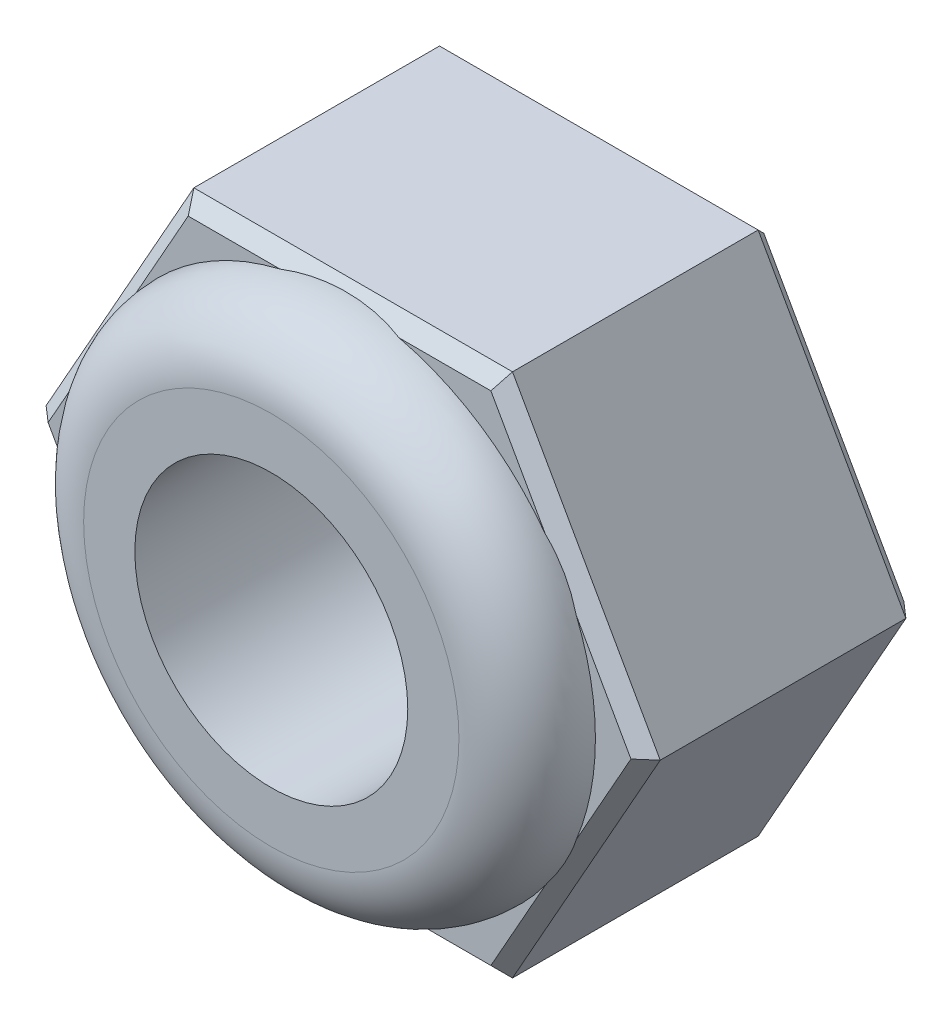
ISO-10303-21;
HEADER;
FILE_DESCRIPTION(('STEP AP214'),'2;1');
FILE_NAME('part.step','',(''),(''),'','','');
FILE_SCHEMA(('AUTOMOTIVE_DESIGN { 1 0 10303 214 1 1 1 1 }'));
ENDSEC;
DATA;
#1=APPLICATION_CONTEXT('core data for automotive mechanical design processes');
#2=APPLICATION_PROTOCOL_DEFINITION('international standard','automotive_design',2000,#1);
#3=PRODUCT_CONTEXT('',#1,'mechanical');
#4=PRODUCT('Part','Part','',(#3));
#5=PRODUCT_RELATED_PRODUCT_CATEGORY('part','',(#4));
#6=PRODUCT_DEFINITION_FORMATION('','',#4);
#7=PRODUCT_DEFINITION_CONTEXT('part definition',#1,'design');
#8=PRODUCT_DEFINITION('design','',#6,#7);
#9=PRODUCT_DEFINITION_SHAPE('','',#8);
#10=(LENGTH_UNIT() NAMED_UNIT(*) SI_UNIT(.MILLI.,.METRE.));
#11=(NAMED_UNIT(*) PLANE_ANGLE_UNIT() SI_UNIT($,.RADIAN.));
#12=(NAMED_UNIT(*) SI_UNIT($,.STERADIAN.) SOLID_ANGLE_UNIT());
#13=UNCERTAINTY_MEASURE_WITH_UNIT(LENGTH_MEASURE(1.E-05),#10,'distance_accuracy_value','');
#14=(GEOMETRIC_REPRESENTATION_CONTEXT(3) GLOBAL_UNCERTAINTY_ASSIGNED_CONTEXT((#13)) GLOBAL_UNIT_ASSIGNED_CONTEXT((#10,
#11,#12)) REPRESENTATION_CONTEXT('',''));
#15=CARTESIAN_POINT('',(0.,0.,0.));
#16=DIRECTION('',(0.,0.,1.));
#17=DIRECTION('',(1.,0.,0.));
#18=AXIS2_PLACEMENT_3D('',#15,#16,#17);
#19=CARTESIAN_POINT('',(2.3348277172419,3.84689219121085,4.));
#20=DIRECTION('',(0.,0.,1.));
#21=DIRECTION('',(1.,0.,0.));
#22=AXIS2_PLACEMENT_3D('',#19,#20,#21);
#23=PLANE('',#22);
#24=DIRECTION('',(-1.,0.,0.));
#25=VECTOR('',#24,1.);
#26=CARTESIAN_POINT('',(2.3348277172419,3.64689219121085,4.));
#27=LINE('',#26,#25);
#28=CARTESIAN_POINT('',(-0.873314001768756,3.64689219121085,4.));
#29=VERTEX_POINT('',#28);
#30=CARTESIAN_POINT('',(-2.21789254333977,3.64689219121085,4.));
#31=VERTEX_POINT('',#30);
#32=EDGE_CURVE('E189',#29,#31,#27,.T.);
#33=ORIENTED_EDGE('',*,*,#32,.T.);
#34=DIRECTION('',(-0.490484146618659,-0.871450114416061,0.));
#35=VECTOR('',#34,1.);
#36=CARTESIAN_POINT('',(-1.03713674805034,5.74475769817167,4.));
#37=LINE('',#36,#35);
#38=CARTESIAN_POINT('',(-3.01689000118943,2.2273021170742,4.));
#39=VERTEX_POINT('',#38);
#40=EDGE_CURVE('E157',#31,#39,#37,.T.);
#41=ORIENTED_EDGE('',*,*,#40,.T.);
#42=CARTESIAN_POINT('',(0.,0.,4.));
#43=DIRECTION('',(0.,0.,1.));
#44=DIRECTION('',(1.,0.,0.));
#45=AXIS2_PLACEMENT_3D('',#42,#43,#44);
#46=CIRCLE('',#45,3.75);
#47=EDGE_CURVE('E295',#29,#39,#46,.T.);
#48=ORIENTED_EDGE('',*,*,#47,.F.);
#49=EDGE_LOOP('',(#33,#41,#48));
#50=FACE_BOUND('',#49,.T.);
#51=ADVANCED_FACE('F26',(#50),#23,.T.);
#52=CARTESIAN_POINT('',(-3.46935767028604,1.42339641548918,4.));
#53=VERTEX_POINT('',#52);
#54=CARTESIAN_POINT('',(-3.46935767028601,-1.42339641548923,4.));
#55=VERTEX_POINT('',#54);
#56=EDGE_CURVE('E363',#53,#55,#46,.T.);
#57=ORIENTED_EDGE('',*,*,#56,.F.);
#58=DIRECTION('',(-0.490484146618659,-0.871450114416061,0.));
#59=VECTOR('',#58,1.);
#60=CARTESIAN_POINT('',(-1.03713674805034,5.74475769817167,4.));
#61=LINE('',#60,#59);
#62=CARTESIAN_POINT('',(-4.27049747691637,0.,4.));
#63=VERTEX_POINT('',#62);
#64=EDGE_CURVE('E314',#53,#63,#61,.T.);
#65=ORIENTED_EDGE('',*,*,#64,.T.);
#66=DIRECTION('',(0.490484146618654,-0.871450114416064,0.));
#67=VECTOR('',#66,1.);
#68=CARTESIAN_POINT('',(-2.16053769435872,-3.74879536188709,4.));
#69=LINE('',#68,#67);
#70=EDGE_CURVE('E312',#63,#55,#69,.T.);
#71=ORIENTED_EDGE('',*,*,#70,.T.);
#72=EDGE_LOOP('',(#57,#65,#71));
#73=FACE_BOUND('',#72,.T.);
#74=ADVANCED_FACE('F266',(#73),#23,.T.);
#75=CARTESIAN_POINT('',(-3.01689000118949,-2.22730211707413,4.));
#76=VERTEX_POINT('',#75);
#77=CARTESIAN_POINT('',(-0.873314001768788,-3.64689219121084,4.));
#78=VERTEX_POINT('',#77);
#79=EDGE_CURVE('E335',#76,#78,#46,.T.);
#80=ORIENTED_EDGE('',*,*,#79,.F.);
#81=DIRECTION('',(0.490484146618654,-0.871450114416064,0.));
#82=VECTOR('',#81,1.);
#83=CARTESIAN_POINT('',(-2.16053769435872,-3.74879536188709,4.));
#84=LINE('',#83,#82);
#85=CARTESIAN_POINT('',(-2.21789254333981,-3.64689219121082,4.));
#86=VERTEX_POINT('',#85);
#87=EDGE_CURVE('E310',#76,#86,#84,.T.);
#88=ORIENTED_EDGE('',*,*,#87,.T.);
#89=DIRECTION('',(1.,0.,0.));
#90=VECTOR('',#89,1.);
#91=CARTESIAN_POINT('',(2.33482771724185,-3.64689219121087,4.));
#92=LINE('',#91,#90);
#93=EDGE_CURVE('E308',#86,#78,#92,.T.);
#94=ORIENTED_EDGE('',*,*,#93,.T.);
#95=EDGE_LOOP('',(#80,#88,#94));
#96=FACE_BOUND('',#95,.T.);
#97=ADVANCED_FACE('F273',(#96),#23,.T.);
#98=CARTESIAN_POINT('',(0.873314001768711,-3.64689219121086,4.));
#99=VERTEX_POINT('',#98);
#100=CARTESIAN_POINT('',(3.01689000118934,-2.22730211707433,4.));
#101=VERTEX_POINT('',#100);
#102=EDGE_CURVE('E333',#99,#101,#46,.T.);
#103=ORIENTED_EDGE('',*,*,#102,.F.);
#104=DIRECTION('',(1.,0.,0.));
#105=VECTOR('',#104,1.);
#106=CARTESIAN_POINT('',(2.33482771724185,-3.64689219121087,4.));
#107=LINE('',#106,#105);
#108=CARTESIAN_POINT('',(2.21789254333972,-3.64689219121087,4.));
#109=VERTEX_POINT('',#108);
#110=EDGE_CURVE('E306',#99,#109,#107,.T.);
#111=ORIENTED_EDGE('',*,*,#110,.T.);
#112=DIRECTION('',(0.490484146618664,0.871450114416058,0.));
#113=VECTOR('',#112,1.);
#114=CARTESIAN_POINT('',(4.32570997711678,0.098096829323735,4.));
#115=LINE('',#114,#113);
#116=EDGE_CURVE('E304',#109,#101,#115,.T.);
#117=ORIENTED_EDGE('',*,*,#116,.T.);
#118=EDGE_LOOP('',(#103,#111,#117));
#119=FACE_BOUND('',#118,.T.);
#120=ADVANCED_FACE('F286',(#119),#23,.T.);
#121=CARTESIAN_POINT('',(3.46935767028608,-1.42339641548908,4.));
#122=VERTEX_POINT('',#121);
#123=CARTESIAN_POINT('',(3.46935767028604,1.42339641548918,4.));
#124=VERTEX_POINT('',#123);
#125=EDGE_CURVE('E292',#122,#124,#46,.T.);
#126=ORIENTED_EDGE('',*,*,#125,.F.);
#127=DIRECTION('',(0.490484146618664,0.871450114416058,0.));
#128=VECTOR('',#127,1.);
#129=CARTESIAN_POINT('',(4.32570997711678,0.098096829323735,4.));
#130=LINE('',#129,#128);
#131=CARTESIAN_POINT('',(4.27049747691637,0.,4.));
#132=VERTEX_POINT('',#131);
#133=EDGE_CURVE('E300',#122,#132,#130,.T.);
#134=ORIENTED_EDGE('',*,*,#133,.T.);
#135=DIRECTION('',(-0.490484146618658,0.871450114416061,0.));
#136=VECTOR('',#135,1.);
#137=CARTESIAN_POINT('',(2.16053769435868,3.74879536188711,4.));
#138=LINE('',#137,#136);
#139=EDGE_CURVE('E298',#132,#124,#138,.T.);
#140=ORIENTED_EDGE('',*,*,#139,.T.);
#141=EDGE_LOOP('',(#126,#134,#140));
#142=FACE_BOUND('',#141,.T.);
#143=ADVANCED_FACE('F279',(#142),#23,.T.);
#144=CARTESIAN_POINT('',(3.01689000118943,2.2273021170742,4.));
#145=VERTEX_POINT('',#144);
#146=CARTESIAN_POINT('',(0.873314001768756,3.64689219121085,4.));
#147=VERTEX_POINT('',#146);
#148=EDGE_CURVE('E289',#145,#147,#46,.T.);
#149=ORIENTED_EDGE('',*,*,#148,.F.);
#150=DIRECTION('',(-0.490484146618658,0.871450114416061,0.));
#151=VECTOR('',#150,1.);
#152=CARTESIAN_POINT('',(2.16053769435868,3.74879536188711,4.));
#153=LINE('',#152,#151);
#154=CARTESIAN_POINT('',(2.21789254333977,3.64689219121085,4.));
#155=VERTEX_POINT('',#154);
#156=EDGE_CURVE('E162',#145,#155,#153,.T.);
#157=ORIENTED_EDGE('',*,*,#156,.T.);
#158=DIRECTION('',(-1.,0.,0.));
#159=VECTOR('',#158,1.);
#160=CARTESIAN_POINT('',(2.3348277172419,3.64689219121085,4.));
#161=LINE('',#160,#159);
#162=EDGE_CURVE('E192',#155,#147,#161,.T.);
#163=ORIENTED_EDGE('',*,*,#162,.T.);
#164=EDGE_LOOP('',(#149,#157,#163));
#165=FACE_BOUND('',#164,.T.);
#166=ADVANCED_FACE('F269',(#165),#23,.T.);
#167=CARTESIAN_POINT('',(2.3348277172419,3.84689219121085,4.));
#168=DIRECTION('',(0.871450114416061,0.490484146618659,0.));
#169=DIRECTION('',(-0.490484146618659,0.871450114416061,0.));
#170=AXIS2_PLACEMENT_3D('',#167,#168,#169);
#171=PLANE('',#170);
#172=DIRECTION('',(0.,0.,-1.));
#173=VECTOR('',#172,1.);
#174=CARTESIAN_POINT('',(4.5,0.,4.));
#175=LINE('',#174,#173);
#176=CARTESIAN_POINT('',(4.5,0.,3.8));
#177=VERTEX_POINT('',#176);
#178=CARTESIAN_POINT('',(4.5,0.,0.200000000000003));
#179=VERTEX_POINT('',#178);
#180=EDGE_CURVE('E362',#177,#179,#175,.T.);
#181=ORIENTED_EDGE('',*,*,#180,.T.);
#182=DIRECTION('',(-0.490484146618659,0.871450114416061,0.));
#183=VECTOR('',#182,1.);
#184=CARTESIAN_POINT('',(2.3348277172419,3.84689219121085,0.200000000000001));
#185=LINE('',#184,#183);
#186=CARTESIAN_POINT('',(2.3348277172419,3.84689219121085,0.200000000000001));
#187=VERTEX_POINT('',#186);
#188=EDGE_CURVE('E377',#179,#187,#185,.T.);
#189=ORIENTED_EDGE('',*,*,#188,.T.);
#190=DIRECTION('',(0.,0.,-1.));
#191=VECTOR('',#190,1.);
#192=CARTESIAN_POINT('',(2.3348277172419,3.84689219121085,4.));
#193=LINE('',#192,#191);
#194=CARTESIAN_POINT('',(2.3348277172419,3.84689219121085,3.8));
#195=VERTEX_POINT('',#194);
#196=EDGE_CURVE('E184',#195,#187,#193,.T.);
#197=ORIENTED_EDGE('',*,*,#196,.F.);
#198=DIRECTION('',(0.490484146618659,-0.871450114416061,0.));
#199=VECTOR('',#198,1.);
#200=CARTESIAN_POINT('',(2.3348277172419,3.84689219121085,3.8));
#201=LINE('',#200,#199);
#202=EDGE_CURVE('E322',#195,#177,#201,.T.);
#203=ORIENTED_EDGE('',*,*,#202,.T.);
#204=EDGE_LOOP('',(#181,#189,#197,#203));
#205=FACE_BOUND('',#204,.T.);
#206=ADVANCED_FACE('F278',(#205),#171,.T.);
#207=CARTESIAN_POINT('',(-2.3348277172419,3.84689219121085,4.));
#208=DIRECTION('',(0.,1.,0.));
#209=DIRECTION('',(0.,0.,1.));
#210=AXIS2_PLACEMENT_3D('',#207,#208,#209);
#211=PLANE('',#210);
#212=ORIENTED_EDGE('',*,*,#196,.T.);
#213=DIRECTION('',(-1.,0.,0.));
#214=VECTOR('',#213,1.);
#215=CARTESIAN_POINT('',(-2.3348277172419,3.84689219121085,0.200000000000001));
#216=LINE('',#215,#214);
#217=CARTESIAN_POINT('',(-2.3348277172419,3.84689219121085,0.200000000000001));
#218=VERTEX_POINT('',#217);
#219=EDGE_CURVE('E183',#187,#218,#216,.T.);
#220=ORIENTED_EDGE('',*,*,#219,.T.);
#221=DIRECTION('',(0.,0.,-1.));
#222=VECTOR('',#221,1.);
#223=CARTESIAN_POINT('',(-2.3348277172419,3.84689219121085,4.));
#224=LINE('',#223,#222);
#225=CARTESIAN_POINT('',(-2.3348277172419,3.84689219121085,3.8));
#226=VERTEX_POINT('',#225);
#227=EDGE_CURVE('E170',#226,#218,#224,.T.);
#228=ORIENTED_EDGE('',*,*,#227,.F.);
#229=DIRECTION('',(1.,0.,0.));
#230=VECTOR('',#229,1.);
#231=CARTESIAN_POINT('',(-2.3348277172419,3.84689219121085,3.8));
#232=LINE('',#231,#230);
#233=EDGE_CURVE('E180',#226,#195,#232,.T.);
#234=ORIENTED_EDGE('',*,*,#233,.T.);
#235=EDGE_LOOP('',(#212,#220,#228,#234));
#236=FACE_BOUND('',#235,.T.);
#237=ADVANCED_FACE('F28',(#236),#211,.T.);
#238=CARTESIAN_POINT('',(-4.5,0.,4.));
#239=DIRECTION('',(-0.871450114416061,0.490484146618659,0.));
#240=DIRECTION('',(-0.490484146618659,-0.871450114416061,0.));
#241=AXIS2_PLACEMENT_3D('',#238,#239,#240);
#242=PLANE('',#241);
#243=ORIENTED_EDGE('',*,*,#227,.T.);
#244=DIRECTION('',(-0.490484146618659,-0.871450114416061,0.));
#245=VECTOR('',#244,1.);
#246=CARTESIAN_POINT('',(-4.5,0.,0.2));
#247=LINE('',#246,#245);
#248=CARTESIAN_POINT('',(-4.5,0.,0.200000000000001));
#249=VERTEX_POINT('',#248);
#250=EDGE_CURVE('E388',#218,#249,#247,.T.);
#251=ORIENTED_EDGE('',*,*,#250,.T.);
#252=DIRECTION('',(0.,0.,-1.));
#253=VECTOR('',#252,1.);
#254=CARTESIAN_POINT('',(-4.5,0.,4.));
#255=LINE('',#254,#253);
#256=CARTESIAN_POINT('',(-4.5,0.,3.8));
#257=VERTEX_POINT('',#256);
#258=EDGE_CURVE('E173',#257,#249,#255,.T.);
#259=ORIENTED_EDGE('',*,*,#258,.F.);
#260=DIRECTION('',(0.490484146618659,0.871450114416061,0.));
#261=VECTOR('',#260,1.);
#262=CARTESIAN_POINT('',(-4.5,0.,3.8));
#263=LINE('',#262,#261);
#264=EDGE_CURVE('E156',#257,#226,#263,.T.);
#265=ORIENTED_EDGE('',*,*,#264,.T.);
#266=EDGE_LOOP('',(#243,#251,#259,#265));
#267=FACE_BOUND('',#266,.T.);
#268=ADVANCED_FACE('F169',(#267),#242,.T.);
#269=CARTESIAN_POINT('',(-4.5,0.,4.));
#270=DIRECTION('',(0.871450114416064,0.490484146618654,0.));
#271=DIRECTION('',(-0.490484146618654,0.871450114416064,0.));
#272=AXIS2_PLACEMENT_3D('',#269,#270,#271);
#273=PLANE('',#272);
#274=ORIENTED_EDGE('',*,*,#258,.T.);
#275=DIRECTION('',(0.490484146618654,-0.871450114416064,0.));
#276=VECTOR('',#275,1.);
#277=CARTESIAN_POINT('',(-4.5,0.,0.200000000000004));
#278=LINE('',#277,#276);
#279=CARTESIAN_POINT('',(-2.33482771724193,-3.84689219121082,0.200000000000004));
#280=VERTEX_POINT('',#279);
#281=EDGE_CURVE('E404',#249,#280,#278,.T.);
#282=ORIENTED_EDGE('',*,*,#281,.T.);
#283=DIRECTION('',(0.,0.,-1.));
#284=VECTOR('',#283,1.);
#285=CARTESIAN_POINT('',(-2.33482771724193,-3.84689219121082,4.));
#286=LINE('',#285,#284);
#287=CARTESIAN_POINT('',(-2.33482771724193,-3.84689219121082,3.8));
#288=VERTEX_POINT('',#287);
#289=EDGE_CURVE('E367',#288,#280,#286,.T.);
#290=ORIENTED_EDGE('',*,*,#289,.F.);
#291=DIRECTION('',(-0.490484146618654,0.871450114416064,0.));
#292=VECTOR('',#291,1.);
#293=CARTESIAN_POINT('',(-4.5,0.,3.8));
#294=LINE('',#293,#292);
#295=EDGE_CURVE('E317',#288,#257,#294,.T.);
#296=ORIENTED_EDGE('',*,*,#295,.T.);
#297=EDGE_LOOP('',(#274,#282,#290,#296));
#298=FACE_BOUND('',#297,.T.);
#299=ADVANCED_FACE('F415',(#298),#273,.F.);
#300=CARTESIAN_POINT('',(-2.33482771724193,-3.84689219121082,4.));
#301=DIRECTION('',(0.,1.,0.));
#302=DIRECTION('',(-1.,0.,0.));
#303=AXIS2_PLACEMENT_3D('',#300,#301,#302);
#304=PLANE('',#303);
#305=ORIENTED_EDGE('',*,*,#289,.T.);
#306=DIRECTION('',(1.,0.,0.));
#307=VECTOR('',#306,1.);
#308=CARTESIAN_POINT('',(-2.33482771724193,-3.84689219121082,0.200000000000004));
#309=LINE('',#308,#307);
#310=CARTESIAN_POINT('',(2.33482771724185,-3.84689219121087,0.200000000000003));
#311=VERTEX_POINT('',#310);
#312=EDGE_CURVE('E11',#280,#311,#309,.T.);
#313=ORIENTED_EDGE('',*,*,#312,.T.);
#314=DIRECTION('',(0.,0.,-1.));
#315=VECTOR('',#314,1.);
#316=CARTESIAN_POINT('',(2.33482771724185,-3.84689219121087,4.));
#317=LINE('',#316,#315);
#318=CARTESIAN_POINT('',(2.33482771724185,-3.84689219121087,3.8));
#319=VERTEX_POINT('',#318);
#320=EDGE_CURVE('E365',#319,#311,#317,.T.);
#321=ORIENTED_EDGE('',*,*,#320,.F.);
#322=DIRECTION('',(-1.,0.,0.));
#323=VECTOR('',#322,1.);
#324=CARTESIAN_POINT('',(-2.33482771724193,-3.84689219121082,3.8));
#325=LINE('',#324,#323);
#326=EDGE_CURVE('E319',#319,#288,#325,.T.);
#327=ORIENTED_EDGE('',*,*,#326,.T.);
#328=EDGE_LOOP('',(#305,#313,#321,#327));
#329=FACE_BOUND('',#328,.T.);
#330=ADVANCED_FACE('F414',(#329),#304,.F.);
#331=CARTESIAN_POINT('',(2.33482771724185,-3.84689219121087,4.));
#332=DIRECTION('',(-0.871450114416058,0.490484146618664,0.));
#333=DIRECTION('',(-0.490484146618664,-0.871450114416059,0.));
#334=AXIS2_PLACEMENT_3D('',#331,#332,#333);
#335=PLANE('',#334);
#336=ORIENTED_EDGE('',*,*,#320,.T.);
#337=DIRECTION('',(0.490484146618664,0.871450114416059,0.));
#338=VECTOR('',#337,1.);
#339=CARTESIAN_POINT('',(2.33482771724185,-3.84689219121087,0.200000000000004));
#340=LINE('',#339,#338);
#341=EDGE_CURVE('E34',#311,#179,#340,.T.);
#342=ORIENTED_EDGE('',*,*,#341,.T.);
#343=ORIENTED_EDGE('',*,*,#180,.F.);
#344=DIRECTION('',(-0.490484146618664,-0.871450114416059,0.));
#345=VECTOR('',#344,1.);
#346=CARTESIAN_POINT('',(2.33482771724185,-3.84689219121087,3.8));
#347=LINE('',#346,#345);
#348=EDGE_CURVE('E321',#177,#319,#347,.T.);
#349=ORIENTED_EDGE('',*,*,#348,.T.);
#350=EDGE_LOOP('',(#336,#342,#343,#349));
#351=FACE_BOUND('',#350,.T.);
#352=ADVANCED_FACE('F413',(#351),#335,.F.);
#353=CARTESIAN_POINT('',(2.3348277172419,3.84689219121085,0.));
#354=DIRECTION('',(0.,0.,1.));
#355=DIRECTION('',(1.,0.,0.));
#356=AXIS2_PLACEMENT_3D('',#353,#354,#355);
#357=PLANE('',#356);
#358=DIRECTION('',(-1.,0.,0.));
#359=VECTOR('',#358,1.);
#360=CARTESIAN_POINT('',(2.33482771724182,-3.64689219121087,0.));
#361=LINE('',#360,#359);
#362=CARTESIAN_POINT('',(2.21789254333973,-3.64689219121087,0.));
#363=VERTEX_POINT('',#362);
#364=CARTESIAN_POINT('',(-2.21789254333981,-3.64689219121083,0.));
#365=VERTEX_POINT('',#364);
#366=EDGE_CURVE('E403',#363,#365,#361,.T.);
#367=ORIENTED_EDGE('',*,*,#366,.T.);
#368=DIRECTION('',(-0.490484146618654,0.871450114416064,0.));
#369=VECTOR('',#368,1.);
#370=CARTESIAN_POINT('',(-4.32570997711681,0.098096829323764,0.));
#371=LINE('',#370,#369);
#372=CARTESIAN_POINT('',(-4.27049747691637,0.,0.));
#373=VERTEX_POINT('',#372);
#374=EDGE_CURVE('E391',#365,#373,#371,.T.);
#375=ORIENTED_EDGE('',*,*,#374,.T.);
#376=DIRECTION('',(0.490484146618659,0.871450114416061,0.));
#377=VECTOR('',#376,1.);
#378=CARTESIAN_POINT('',(-2.16053769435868,3.74879536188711,0.));
#379=LINE('',#378,#377);
#380=CARTESIAN_POINT('',(-2.21789254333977,3.64689219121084,0.));
#381=VERTEX_POINT('',#380);
#382=EDGE_CURVE('E396',#373,#381,#379,.T.);
#383=ORIENTED_EDGE('',*,*,#382,.T.);
#384=DIRECTION('',(1.,0.,0.));
#385=VECTOR('',#384,1.);
#386=CARTESIAN_POINT('',(2.3348277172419,3.64689219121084,0.));
#387=LINE('',#386,#385);
#388=CARTESIAN_POINT('',(2.21789254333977,3.64689219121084,0.));
#389=VERTEX_POINT('',#388);
#390=EDGE_CURVE('E398',#381,#389,#387,.T.);
#391=ORIENTED_EDGE('',*,*,#390,.T.);
#392=DIRECTION('',(0.490484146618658,-0.871450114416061,0.));
#393=VECTOR('',#392,1.);
#394=CARTESIAN_POINT('',(4.32570997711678,-0.0980968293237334,0.));
#395=LINE('',#394,#393);
#396=CARTESIAN_POINT('',(4.27049747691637,0.,0.));
#397=VERTEX_POINT('',#396);
#398=EDGE_CURVE('E379',#389,#397,#395,.T.);
#399=ORIENTED_EDGE('',*,*,#398,.T.);
#400=DIRECTION('',(-0.490484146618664,-0.871450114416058,0.));
#401=VECTOR('',#400,1.);
#402=CARTESIAN_POINT('',(5.44911092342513,2.09405916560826,0.));
#403=LINE('',#402,#401);
#404=EDGE_CURVE('E401',#397,#363,#403,.T.);
#405=ORIENTED_EDGE('',*,*,#404,.T.);
#406=EDGE_LOOP('',(#367,#375,#383,#391,#399,#405));
#407=FACE_BOUND('',#406,.T.);
#408=CARTESIAN_POINT('',(0.,0.,0.));
#409=DIRECTION('',(0.,0.,1.));
#410=DIRECTION('',(1.,0.,0.));
#411=AXIS2_PLACEMENT_3D('',#408,#409,#410);
#412=CIRCLE('',#411,2.);
#413=CARTESIAN_POINT('',(2.,0.,0.));
#414=VERTEX_POINT('',#413);
#415=EDGE_CURVE('E293',#414,#414,#412,.T.);
#416=ORIENTED_EDGE('',*,*,#415,.T.);
#417=EDGE_LOOP('',(#416));
#418=FACE_BOUND('',#417,.T.);
#419=ADVANCED_FACE('F443',(#407,#418),#357,.F.);
#420=CARTESIAN_POINT('',(0.,0.,5.));
#421=DIRECTION('',(0.,0.,1.));
#422=DIRECTION('',(1.,0.,0.));
#423=AXIS2_PLACEMENT_3D('',#420,#421,#422);
#424=PLANE('',#423);
#425=CARTESIAN_POINT('',(0.,0.,5.));
#426=DIRECTION('',(0.,0.,1.));
#427=DIRECTION('',(1.,0.,0.));
#428=AXIS2_PLACEMENT_3D('',#425,#426,#427);
#429=CIRCLE('',#428,2.75);
#430=CARTESIAN_POINT('',(2.75,0.,5.));
#431=VERTEX_POINT('',#430);
#432=EDGE_CURVE('E190',#431,#431,#429,.T.);
#433=ORIENTED_EDGE('',*,*,#432,.T.);
#434=EDGE_LOOP('',(#433));
#435=FACE_BOUND('',#434,.T.);
#436=CARTESIAN_POINT('',(0.,0.,5.));
#437=DIRECTION('',(0.,0.,1.));
#438=DIRECTION('',(1.,0.,0.));
#439=AXIS2_PLACEMENT_3D('',#436,#437,#438);
#440=CIRCLE('',#439,2.);
#441=CARTESIAN_POINT('',(2.,0.,5.));
#442=VERTEX_POINT('',#441);
#443=EDGE_CURVE('E351',#442,#442,#440,.T.);
#444=ORIENTED_EDGE('',*,*,#443,.F.);
#445=EDGE_LOOP('',(#444));
#446=FACE_BOUND('',#445,.T.);
#447=ADVANCED_FACE('F513',(#435,#446),#424,.T.);
#448=CARTESIAN_POINT('',(0.,0.,-6.));
#449=DIRECTION('',(0.,0.,1.));
#450=DIRECTION('',(1.,0.,0.));
#451=AXIS2_PLACEMENT_3D('',#448,#449,#450);
#452=CYLINDRICAL_SURFACE('',#451,2.);
#453=ORIENTED_EDGE('',*,*,#443,.T.);
#454=EDGE_LOOP('',(#453));
#455=FACE_BOUND('',#454,.T.);
#456=ORIENTED_EDGE('',*,*,#415,.F.);
#457=EDGE_LOOP('',(#456));
#458=FACE_BOUND('',#457,.T.);
#459=ADVANCED_FACE('F212',(#455,#458),#452,.F.);
#460=CARTESIAN_POINT('',(0.,0.,4.));
#461=DIRECTION('',(0.,0.,1.));
#462=DIRECTION('',(1.,0.,0.));
#463=AXIS2_PLACEMENT_3D('',#460,#461,#462);
#464=TOROIDAL_SURFACE('',#463,2.75,1.);
#465=ORIENTED_EDGE('',*,*,#47,.T.);
#466=CARTESIAN_POINT('',(-3.01689000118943,2.2273021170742,4.));
#467=CARTESIAN_POINT('',(-3.06259153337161,2.16536583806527,3.99055215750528));
#468=CARTESIAN_POINT('',(-3.10647510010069,2.10174433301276,3.98351515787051));
#469=CARTESIAN_POINT('',(-3.19008557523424,1.97215098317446,3.97421628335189));
#470=CARTESIAN_POINT('',(-3.22984055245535,1.90619974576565,3.97191984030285));
#471=CARTESIAN_POINT('',(-3.30534803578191,1.77204453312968,3.97191984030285));
#472=CARTESIAN_POINT('',(-3.34110054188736,1.70384055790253,3.97421628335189));
#473=CARTESIAN_POINT('',(-3.40850400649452,1.56512530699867,3.98351515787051));
#474=CARTESIAN_POINT('',(-3.44012278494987,1.49460072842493,3.99055215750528));
#475=CARTESIAN_POINT('',(-3.46935767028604,1.42339641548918,4.));
#476=B_SPLINE_CURVE_WITH_KNOTS('',3,(#466,#467,#468,#469,#470,#471,#472,#473,#474,#475),
.UNSPECIFIED.,.F.,.F.,(4,2,2,2,4),(0.,0.232543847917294,0.463385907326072,0.694227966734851,
0.926771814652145),.UNSPECIFIED.);
#477=EDGE_CURVE('E221',#39,#53,#476,.T.);
#478=ORIENTED_EDGE('',*,*,#477,.T.);
#479=ORIENTED_EDGE('',*,*,#56,.T.);
#480=CARTESIAN_POINT('',(-3.46935767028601,-1.42339641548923,4.));
#481=CARTESIAN_POINT('',(-3.44012278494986,-1.49460072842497,3.99055215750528));
#482=CARTESIAN_POINT('',(-3.4085040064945,-1.5651253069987,3.98351515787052));
#483=CARTESIAN_POINT('',(-3.34110054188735,-1.70384055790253,3.9742162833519));
#484=CARTESIAN_POINT('',(-3.30534803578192,-1.77204453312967,3.97191984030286));
#485=CARTESIAN_POINT('',(-3.22984055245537,-1.90619974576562,3.97191984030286));
#486=CARTESIAN_POINT('',(-3.19008557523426,-1.97215098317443,3.9742162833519));
#487=CARTESIAN_POINT('',(-3.10647510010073,-2.1017443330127,3.98351515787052));
#488=CARTESIAN_POINT('',(-3.06259153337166,-2.16536583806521,3.99055215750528));
#489=CARTESIAN_POINT('',(-3.01689000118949,-2.22730211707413,4.));
#490=B_SPLINE_CURVE_WITH_KNOTS('',3,(#480,#481,#482,#483,#484,#485,#486,#487,#488,#489),
.UNSPECIFIED.,.F.,.F.,(4,2,2,2,4),(0.,0.232543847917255,0.463385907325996,0.694227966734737,
0.926771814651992),.UNSPECIFIED.);
#491=EDGE_CURVE('E229',#55,#76,#490,.T.);
#492=ORIENTED_EDGE('',*,*,#491,.T.);
#493=ORIENTED_EDGE('',*,*,#79,.T.);
#494=CARTESIAN_POINT('',(-0.873314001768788,-3.64689219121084,4.));
#495=CARTESIAN_POINT('',(-0.802880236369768,-3.66373604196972,3.98315614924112));
#496=CARTESIAN_POINT('',(-0.731392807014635,-3.67828382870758,3.96860836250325));
#497=CARTESIAN_POINT('',(-0.586979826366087,-3.70298845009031,3.94390374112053));
#498=CARTESIAN_POINT('',(-0.514055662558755,-3.71314932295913,3.93374286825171));
#499=CARTESIAN_POINT('',(-0.369066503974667,-3.72911771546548,3.91777447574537));
#500=CARTESIAN_POINT('',(-0.297022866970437,-3.73502382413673,3.91186836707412));
#501=CARTESIAN_POINT('',(-0.152486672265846,-3.74297621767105,3.9039159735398));
#502=CARTESIAN_POINT('',(-0.0799939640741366,-3.7450211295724,3.90187106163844));
#503=CARTESIAN_POINT('',(0.0662232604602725,-3.74528745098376,3.90160474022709));
#504=CARTESIAN_POINT('',(0.139948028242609,-3.74344410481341,3.90344808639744));
#505=CARTESIAN_POINT('',(0.286957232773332,-3.7357677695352,3.91112442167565));
#506=CARTESIAN_POINT('',(0.360241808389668,-3.72993611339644,3.91695607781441));
#507=CARTESIAN_POINT('',(0.507762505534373,-3.71398466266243,3.93290752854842));
#508=CARTESIAN_POINT('',(0.581976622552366,-3.7037613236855,3.94313086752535));
#509=CARTESIAN_POINT('',(0.7289289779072,-3.67878373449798,3.96810845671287));
#510=CARTESIAN_POINT('',(0.801665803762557,-3.66402534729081,3.98286684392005));
#511=CARTESIAN_POINT('',(0.873314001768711,-3.64689219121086,4.));
#512=B_SPLINE_CURVE_WITH_KNOTS('',3,(#494,#495,#496,#497,#498,#499,#500,#501,#502,#503,#504,
#505,#506,#507,#508,#509,#510,#511),.UNSPECIFIED.,.F.,.F.,(4,2,2,2,2,2,2,2,4),(0.,
0.222919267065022,0.445632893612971,0.663003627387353,0.880451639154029,1.10154963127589,
1.32257376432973,1.54912271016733,1.77587893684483),.UNSPECIFIED.);
#513=EDGE_CURVE('E235',#78,#99,#512,.T.);
#514=ORIENTED_EDGE('',*,*,#513,.T.);
#515=ORIENTED_EDGE('',*,*,#102,.T.);
#516=CARTESIAN_POINT('',(3.01689000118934,-2.22730211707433,4.));
#517=CARTESIAN_POINT('',(3.06259153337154,-2.16536583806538,3.99055215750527));
#518=CARTESIAN_POINT('',(3.10647510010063,-2.10174433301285,3.9835151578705));
#519=CARTESIAN_POINT('',(3.19008557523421,-1.97215098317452,3.97421628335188));
#520=CARTESIAN_POINT('',(3.22984055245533,-1.90619974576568,3.97191984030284));
#521=CARTESIAN_POINT('',(3.30534803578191,-1.77204453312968,3.97191984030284));
#522=CARTESIAN_POINT('',(3.34110054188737,-1.70384055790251,3.97421628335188));
#523=CARTESIAN_POINT('',(3.40850400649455,-1.56512530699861,3.9835151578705));
#524=CARTESIAN_POINT('',(3.44012278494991,-1.49460072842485,3.99055215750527));
#525=CARTESIAN_POINT('',(3.46935767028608,-1.42339641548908,4.));
#526=B_SPLINE_CURVE_WITH_KNOTS('',3,(#516,#517,#518,#519,#520,#521,#522,#523,#524,#525),
.UNSPECIFIED.,.F.,.F.,(4,2,2,2,4),(0.,0.232543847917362,0.463385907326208,0.694227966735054,
0.926771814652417),.UNSPECIFIED.);
#527=EDGE_CURVE('E241',#101,#122,#526,.T.);
#528=ORIENTED_EDGE('',*,*,#527,.T.);
#529=ORIENTED_EDGE('',*,*,#125,.T.);
#530=CARTESIAN_POINT('',(3.46935767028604,1.42339641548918,4.));
#531=CARTESIAN_POINT('',(3.44012278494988,1.49460072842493,3.99055215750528));
#532=CARTESIAN_POINT('',(3.40850400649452,1.56512530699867,3.98351515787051));
#533=CARTESIAN_POINT('',(3.34110054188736,1.70384055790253,3.97421628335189));
#534=CARTESIAN_POINT('',(3.30534803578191,1.77204453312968,3.97191984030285));
#535=CARTESIAN_POINT('',(3.22984055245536,1.90619974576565,3.97191984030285));
#536=CARTESIAN_POINT('',(3.19008557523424,1.97215098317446,3.97421628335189));
#537=CARTESIAN_POINT('',(3.10647510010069,2.10174433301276,3.98351515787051));
#538=CARTESIAN_POINT('',(3.06259153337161,2.16536583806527,3.99055215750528));
#539=CARTESIAN_POINT('',(3.01689000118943,2.2273021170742,4.));
#540=B_SPLINE_CURVE_WITH_KNOTS('',3,(#530,#531,#532,#533,#534,#535,#536,#537,#538,#539),
.UNSPECIFIED.,.F.,.F.,(4,2,2,2,4),(0.,0.232543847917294,0.463385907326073,0.694227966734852,
0.926771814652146),.UNSPECIFIED.);
#541=EDGE_CURVE('E246',#124,#145,#540,.T.);
#542=ORIENTED_EDGE('',*,*,#541,.T.);
#543=ORIENTED_EDGE('',*,*,#148,.T.);
#544=CARTESIAN_POINT('',(0.873314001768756,3.64689219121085,4.));
#545=CARTESIAN_POINT('',(0.802880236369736,3.66373604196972,3.98315614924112));
#546=CARTESIAN_POINT('',(0.731392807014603,3.67828382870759,3.96860836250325));
#547=CARTESIAN_POINT('',(0.586979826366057,3.70298845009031,3.94390374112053));
#548=CARTESIAN_POINT('',(0.514055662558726,3.71314932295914,3.93374286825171));
#549=CARTESIAN_POINT('',(0.369066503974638,3.72911771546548,3.91777447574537));
#550=CARTESIAN_POINT('',(0.297022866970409,3.73502382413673,3.91186836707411));
#551=CARTESIAN_POINT('',(0.152486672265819,3.74297621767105,3.9039159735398));
#552=CARTESIAN_POINT('',(0.0799939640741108,3.7450211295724,3.90187106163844));
#553=CARTESIAN_POINT('',(-0.0662232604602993,3.74528745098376,3.90160474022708));
#554=CARTESIAN_POINT('',(-0.139948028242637,3.74344410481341,3.90344808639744));
#555=CARTESIAN_POINT('',(-0.286957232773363,3.7357677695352,3.91112442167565));
#556=CARTESIAN_POINT('',(-0.360241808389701,3.72993611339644,3.91695607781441));
#557=CARTESIAN_POINT('',(-0.507762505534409,3.71398466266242,3.93290752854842));
#558=CARTESIAN_POINT('',(-0.581976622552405,3.7037613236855,3.94313086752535));
#559=CARTESIAN_POINT('',(-0.728928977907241,3.67878373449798,3.96810845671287));
#560=CARTESIAN_POINT('',(-0.8016658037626,3.6640253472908,3.98286684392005));
#561=CARTESIAN_POINT('',(-0.873314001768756,3.64689219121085,4.));
#562=B_SPLINE_CURVE_WITH_KNOTS('',3,(#544,#545,#546,#547,#548,#549,#550,#551,#552,#553,#554,
#555,#556,#557,#558,#559,#560,#561),.UNSPECIFIED.,.F.,.F.,(4,2,2,2,2,2,2,2,4),(0.,
0.22291926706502,0.445632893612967,0.663003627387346,0.880451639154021,1.10154963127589,
1.32257376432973,1.54912271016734,1.77587893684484),.UNSPECIFIED.);
#563=EDGE_CURVE('E175',#147,#29,#562,.T.);
#564=ORIENTED_EDGE('',*,*,#563,.T.);
#565=EDGE_LOOP('',(#465,#478,#479,#492,#493,#514,#515,#528,#529,#542,#543,#564));
#566=FACE_BOUND('',#565,.T.);
#567=ORIENTED_EDGE('',*,*,#432,.F.);
#568=EDGE_LOOP('',(#567));
#569=FACE_BOUND('',#568,.T.);
#570=ADVANCED_FACE('F208',(#566,#569),#464,.T.);
#571=CARTESIAN_POINT('',(-2.3348277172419,3.84689219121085,3.8));
#572=DIRECTION('',(0.,-0.707106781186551,-0.707106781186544));
#573=DIRECTION('',(0.,0.707106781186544,-0.707106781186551));
#574=AXIS2_PLACEMENT_3D('',#571,#572,#573);
#575=PLANE('',#574);
#576=ORIENTED_EDGE('',*,*,#233,.F.);
#577=DIRECTION('',(0.382063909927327,-0.65346276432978,0.653462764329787));
#578=VECTOR('',#577,1.);
#579=CARTESIAN_POINT('',(-2.3348277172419,3.84689219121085,3.8));
#580=LINE('',#579,#578);
#581=EDGE_CURVE('E151',#226,#31,#580,.T.);
#582=ORIENTED_EDGE('',*,*,#581,.T.);
#583=ORIENTED_EDGE('',*,*,#32,.F.);
#584=ORIENTED_EDGE('',*,*,#563,.F.);
#585=ORIENTED_EDGE('',*,*,#162,.F.);
#586=DIRECTION('',(0.382063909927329,0.653462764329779,-0.653462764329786));
#587=VECTOR('',#586,1.);
#588=CARTESIAN_POINT('',(1.65318489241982,2.68104482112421,4.96584737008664));
#589=LINE('',#588,#587);
#590=EDGE_CURVE('E163',#155,#195,#589,.T.);
#591=ORIENTED_EDGE('',*,*,#590,.T.);
#592=EDGE_LOOP('',(#576,#582,#583,#584,#585,#591));
#593=FACE_BOUND('',#592,.T.);
#594=ADVANCED_FACE('F186',(#593),#575,.F.);
#595=CARTESIAN_POINT('',(2.3348277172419,3.84689219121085,3.8));
#596=DIRECTION('',(-0.616208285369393,-0.346824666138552,-0.707106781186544));
#597=DIRECTION('',(-0.753901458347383,0.,0.656987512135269));
#598=AXIS2_PLACEMENT_3D('',#595,#596,#597);
#599=PLANE('',#598);
#600=ORIENTED_EDGE('',*,*,#541,.F.);
#601=ORIENTED_EDGE('',*,*,#139,.F.);
#602=DIRECTION('',(-0.753901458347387,0.,0.656987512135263));
#603=VECTOR('',#602,1.);
#604=CARTESIAN_POINT('',(3.26938663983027,0.,4.87241815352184));
#605=LINE('',#604,#603);
#606=EDGE_CURVE('E347',#177,#132,#605,.T.);
#607=ORIENTED_EDGE('',*,*,#606,.F.);
#608=ORIENTED_EDGE('',*,*,#202,.F.);
#609=ORIENTED_EDGE('',*,*,#590,.F.);
#610=ORIENTED_EDGE('',*,*,#156,.F.);
#611=EDGE_LOOP('',(#600,#601,#607,#608,#609,#610));
#612=FACE_BOUND('',#611,.T.);
#613=ADVANCED_FACE('F255',(#612),#599,.F.);
#614=CARTESIAN_POINT('',(5.44911092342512,2.09405916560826,4.));
#615=DIRECTION('',(0.616208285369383,-0.346824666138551,0.707106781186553));
#616=DIRECTION('',(0.753901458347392,0.,-0.656987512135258));
#617=AXIS2_PLACEMENT_3D('',#614,#615,#616);
#618=PLANE('',#617);
#619=ORIENTED_EDGE('',*,*,#527,.F.);
#620=ORIENTED_EDGE('',*,*,#116,.F.);
#621=DIRECTION('',(0.38206390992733,-0.653462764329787,-0.653462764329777));
#622=VECTOR('',#621,1.);
#623=CARTESIAN_POINT('',(1.25625066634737,-2.002148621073,5.64474357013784));
#624=LINE('',#623,#622);
#625=EDGE_CURVE('E344',#319,#109,#624,.F.);
#626=ORIENTED_EDGE('',*,*,#625,.F.);
#627=ORIENTED_EDGE('',*,*,#348,.F.);
#628=ORIENTED_EDGE('',*,*,#606,.T.);
#629=ORIENTED_EDGE('',*,*,#133,.F.);
#630=EDGE_LOOP('',(#619,#620,#626,#627,#628,#629));
#631=FACE_BOUND('',#630,.T.);
#632=ADVANCED_FACE('F251',(#631),#618,.T.);
#633=CARTESIAN_POINT('',(2.33482771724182,-3.64689219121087,4.));
#634=DIRECTION('',(0.,-0.707106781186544,0.707106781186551));
#635=DIRECTION('',(0.,-0.707106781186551,-0.707106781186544));
#636=AXIS2_PLACEMENT_3D('',#633,#634,#635);
#637=PLANE('',#636);
#638=ORIENTED_EDGE('',*,*,#513,.F.);
#639=ORIENTED_EDGE('',*,*,#93,.F.);
#640=DIRECTION('',(-0.382063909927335,-0.653462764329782,-0.65346276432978));
#641=VECTOR('',#640,1.);
#642=CARTESIAN_POINT('',(-1.55331907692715,-2.51023938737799,5.13665280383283));
#643=LINE('',#642,#641);
#644=EDGE_CURVE('E348',#288,#86,#643,.F.);
#645=ORIENTED_EDGE('',*,*,#644,.F.);
#646=ORIENTED_EDGE('',*,*,#326,.F.);
#647=ORIENTED_EDGE('',*,*,#625,.T.);
#648=ORIENTED_EDGE('',*,*,#110,.F.);
#649=EDGE_LOOP('',(#638,#639,#645,#646,#647,#648));
#650=FACE_BOUND('',#649,.T.);
#651=ADVANCED_FACE('F254',(#650),#637,.T.);
#652=CARTESIAN_POINT('',(-4.3257099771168,0.0980968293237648,4.));
#653=DIRECTION('',(-0.616208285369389,-0.346824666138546,0.70710678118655));
#654=DIRECTION('',(0.753901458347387,0.,0.656987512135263));
#655=AXIS2_PLACEMENT_3D('',#652,#653,#654);
#656=PLANE('',#655);
#657=ORIENTED_EDGE('',*,*,#491,.F.);
#658=ORIENTED_EDGE('',*,*,#70,.F.);
#659=DIRECTION('',(0.753901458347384,0.,0.656987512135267));
#660=VECTOR('',#659,1.);
#661=CARTESIAN_POINT('',(-4.30187846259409,0.,3.97265303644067));
#662=LINE('',#661,#660);
#663=EDGE_CURVE('E354',#257,#63,#662,.T.);
#664=ORIENTED_EDGE('',*,*,#663,.F.);
#665=ORIENTED_EDGE('',*,*,#295,.F.);
#666=ORIENTED_EDGE('',*,*,#644,.T.);
#667=ORIENTED_EDGE('',*,*,#87,.F.);
#668=EDGE_LOOP('',(#657,#658,#664,#665,#666,#667));
#669=FACE_BOUND('',#668,.T.);
#670=ADVANCED_FACE('F419',(#669),#656,.T.);
#671=CARTESIAN_POINT('',(-4.5,0.,3.8));
#672=DIRECTION('',(0.616208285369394,-0.346824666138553,-0.707106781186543));
#673=DIRECTION('',(-0.753901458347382,0.,-0.65698751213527));
#674=AXIS2_PLACEMENT_3D('',#671,#672,#673);
#675=PLANE('',#674);
#676=ORIENTED_EDGE('',*,*,#477,.F.);
#677=ORIENTED_EDGE('',*,*,#40,.F.);
#678=ORIENTED_EDGE('',*,*,#581,.F.);
#679=ORIENTED_EDGE('',*,*,#264,.F.);
#680=ORIENTED_EDGE('',*,*,#663,.T.);
#681=ORIENTED_EDGE('',*,*,#64,.F.);
#682=EDGE_LOOP('',(#676,#677,#678,#679,#680,#681));
#683=FACE_BOUND('',#682,.T.);
#684=ADVANCED_FACE('F154',(#683),#675,.F.);
#685=CARTESIAN_POINT('',(2.16053769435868,3.74879536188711,0.));
#686=DIRECTION('',(0.616208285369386,0.346824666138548,-0.707106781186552));
#687=DIRECTION('',(-0.75390145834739,0.,-0.65698751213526));
#688=AXIS2_PLACEMENT_3D('',#685,#686,#687);
#689=PLANE('',#688);
#690=DIRECTION('',(-0.753901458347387,0.,-0.656987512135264));
#691=VECTOR('',#690,1.);
#692=CARTESIAN_POINT('',(3.26938663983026,0.,-0.872418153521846));
#693=LINE('',#692,#691);
#694=EDGE_CURVE('E382',#397,#179,#693,.F.);
#695=ORIENTED_EDGE('',*,*,#694,.F.);
#696=ORIENTED_EDGE('',*,*,#398,.F.);
#697=DIRECTION('',(0.382063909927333,0.653462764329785,0.653462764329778));
#698=VECTOR('',#697,1.);
#699=CARTESIAN_POINT('',(2.23496190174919,3.67608675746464,0.0291945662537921));
#700=LINE('',#699,#698);
#701=EDGE_CURVE('E374',#187,#389,#700,.F.);
#702=ORIENTED_EDGE('',*,*,#701,.F.);
#703=ORIENTED_EDGE('',*,*,#188,.F.);
#704=EDGE_LOOP('',(#695,#696,#702,#703));
#705=FACE_BOUND('',#704,.T.);
#706=ADVANCED_FACE('F376',(#705),#689,.T.);
#707=CARTESIAN_POINT('',(2.3348277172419,3.64689219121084,0.));
#708=DIRECTION('',(0.,0.707106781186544,-0.707106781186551));
#709=DIRECTION('',(0.,0.707106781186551,0.707106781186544));
#710=AXIS2_PLACEMENT_3D('',#707,#708,#709);
#711=PLANE('',#710);
#712=ORIENTED_EDGE('',*,*,#701,.T.);
#713=ORIENTED_EDGE('',*,*,#390,.F.);
#714=DIRECTION('',(-0.38206390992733,0.653462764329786,0.653462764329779));
#715=VECTOR('',#714,1.);
#716=CARTESIAN_POINT('',(-1.55331907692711,2.51023938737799,-1.13665280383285));
#717=LINE('',#716,#715);
#718=EDGE_CURVE('E386',#218,#381,#717,.F.);
#719=ORIENTED_EDGE('',*,*,#718,.F.);
#720=ORIENTED_EDGE('',*,*,#219,.F.);
#721=EDGE_LOOP('',(#712,#713,#719,#720));
#722=FACE_BOUND('',#721,.T.);
#723=ADVANCED_FACE('F384',(#722),#711,.T.);
#724=CARTESIAN_POINT('',(2.33482771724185,-3.84689219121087,0.200000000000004));
#725=DIRECTION('',(-0.61620828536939,0.346824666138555,0.707106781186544));
#726=DIRECTION('',(0.753901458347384,0.,0.656987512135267));
#727=AXIS2_PLACEMENT_3D('',#724,#725,#726);
#728=PLANE('',#727);
#729=ORIENTED_EDGE('',*,*,#694,.T.);
#730=ORIENTED_EDGE('',*,*,#341,.F.);
#731=DIRECTION('',(0.382063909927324,-0.653462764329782,0.653462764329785));
#732=VECTOR('',#731,1.);
#733=CARTESIAN_POINT('',(1.65318489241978,-2.68104482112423,-0.965847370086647));
#734=LINE('',#733,#732);
#735=EDGE_CURVE('E425',#363,#311,#734,.T.);
#736=ORIENTED_EDGE('',*,*,#735,.F.);
#737=ORIENTED_EDGE('',*,*,#404,.F.);
#738=EDGE_LOOP('',(#729,#730,#736,#737));
#739=FACE_BOUND('',#738,.T.);
#740=ADVANCED_FACE('F441',(#739),#728,.F.);
#741=CARTESIAN_POINT('',(-1.03713674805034,5.74475769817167,0.));
#742=DIRECTION('',(-0.616208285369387,0.346824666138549,-0.707106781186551));
#743=DIRECTION('',(-0.753901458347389,0.,0.656987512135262));
#744=AXIS2_PLACEMENT_3D('',#741,#742,#743);
#745=PLANE('',#744);
#746=ORIENTED_EDGE('',*,*,#718,.T.);
#747=ORIENTED_EDGE('',*,*,#382,.F.);
#748=DIRECTION('',(0.753901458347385,0.,-0.656987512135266));
#749=VECTOR('',#748,1.);
#750=CARTESIAN_POINT('',(-2.4327606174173,0.,-1.60149599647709));
#751=LINE('',#750,#749);
#752=EDGE_CURVE('E428',#249,#373,#751,.T.);
#753=ORIENTED_EDGE('',*,*,#752,.F.);
#754=ORIENTED_EDGE('',*,*,#250,.F.);
#755=EDGE_LOOP('',(#746,#747,#753,#754));
#756=FACE_BOUND('',#755,.T.);
#757=ADVANCED_FACE('F447',(#756),#745,.T.);
#758=CARTESIAN_POINT('',(-2.33482771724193,-3.84689219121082,0.200000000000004));
#759=DIRECTION('',(0.,0.707106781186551,0.707106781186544));
#760=DIRECTION('',(0.,-0.707106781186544,0.707106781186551));
#761=AXIS2_PLACEMENT_3D('',#758,#759,#760);
#762=PLANE('',#761);
#763=ORIENTED_EDGE('',*,*,#735,.T.);
#764=ORIENTED_EDGE('',*,*,#312,.F.);
#765=DIRECTION('',(0.382063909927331,0.653462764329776,-0.653462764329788));
#766=VECTOR('',#765,1.);
#767=CARTESIAN_POINT('',(-2.33482771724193,-3.84689219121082,0.200000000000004));
#768=LINE('',#767,#766);
#769=EDGE_CURVE('E430',#365,#280,#768,.F.);
#770=ORIENTED_EDGE('',*,*,#769,.F.);
#771=ORIENTED_EDGE('',*,*,#366,.F.);
#772=EDGE_LOOP('',(#763,#764,#770,#771));
#773=FACE_BOUND('',#772,.T.);
#774=ADVANCED_FACE('F437',(#773),#762,.F.);
#775=CARTESIAN_POINT('',(-4.5,0.,0.200000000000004));
#776=DIRECTION('',(0.616208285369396,0.34682466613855,0.707106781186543));
#777=DIRECTION('',(0.75390145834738,0.,-0.656987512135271));
#778=AXIS2_PLACEMENT_3D('',#775,#776,#777);
#779=PLANE('',#778);
#780=ORIENTED_EDGE('',*,*,#752,.T.);
#781=ORIENTED_EDGE('',*,*,#374,.F.);
#782=ORIENTED_EDGE('',*,*,#769,.T.);
#783=ORIENTED_EDGE('',*,*,#281,.F.);
#784=EDGE_LOOP('',(#780,#781,#782,#783));
#785=FACE_BOUND('',#784,.T.);
#786=ADVANCED_FACE('F434',(#785),#779,.F.);
#787=CLOSED_SHELL('',(#51,#74,#97,#120,#143,#166,#206,#237,#268,#299,#330,#352,#419,#447,#459,
#570,#594,#613,#632,#651,#670,#684,#706,#723,#740,#757,#774,#786));
#788=MANIFOLD_SOLID_BREP('B2',#787);
#789=ADVANCED_BREP_SHAPE_REPRESENTATION('',(#18,#788),#14);
#790=SHAPE_DEFINITION_REPRESENTATION(#9,#789);
ENDSEC;
END-ISO-10303-21;
